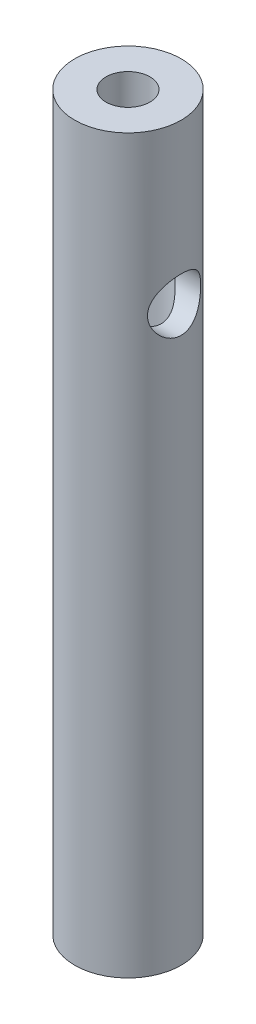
from build123d import *

# Parameters (mm, degrees)
SKETCH1_R                    = 4
BOSS_EXTRUDE1_DEPTH          = 55
M4_TAPPED_HOLE1_D            = 3.3
M4_TAPPED_HOLE1_DEPTH        = 10
M4_TAPPED_HOLE1_TIP          = 0.9914200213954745
F_4_0_4_DIAMETER_HOLE1_D     = 4
F_4_0_4_DIAMETER_HOLE1_DEPTH = 4
F_4_0_4_DIAMETER_HOLE1_TIP   = 1.2017212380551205
M6_TAPPED_HOLE1_D            = 5
M6_TAPPED_HOLE1_DEPTH        = 10
M6_TAPPED_HOLE1_TIP          = 1.5021515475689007
F_5_0_5_DIAMETER_HOLE1_D     = 5
F_5_0_5_DIAMETER_HOLE1_DEPTH = 45
F_5_0_5_DIAMETER_HOLE1_TIP   = 1.5021515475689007


with BuildPart() as part:
    # Sketch1 → Boss-Extrude1 (new body)
    with BuildSketch(Plane(origin=(0, 0, 0), x_dir=(1, 0, 0), z_dir=(0, 1, 0))):
        with Locations(Location((0, 0, 0), (0, 0, 270))):
            Circle(SKETCH1_R)
    extrude(amount=BOSS_EXTRUDE1_DEPTH)

    # M4 Tapped Hole1
    with Locations(Plane(origin=(0, 55, 0), x_dir=(1, 0, 0), z_dir=(0, 1, 0))):
        with Locations((0, 0)):
            Hole(M4_TAPPED_HOLE1_D / 2, depth=M4_TAPPED_HOLE1_DEPTH)
            with Locations((0, 0, -(M4_TAPPED_HOLE1_DEPTH + M4_TAPPED_HOLE1_TIP / 2))):  # 118° drill point
                Cone(0, M4_TAPPED_HOLE1_D / 2, M4_TAPPED_HOLE1_TIP, mode=Mode.SUBTRACT)

    # 4.0 _4_ Diameter Hole1
    with Locations(Plane(origin=(4, 43, 0), x_dir=(0, 0, 1), z_dir=(1, 0, 0))):
        with Locations((0, 0)):
            Hole(F_4_0_4_DIAMETER_HOLE1_D / 2, depth=F_4_0_4_DIAMETER_HOLE1_DEPTH)
            with Locations((0, 0, -(F_4_0_4_DIAMETER_HOLE1_DEPTH + F_4_0_4_DIAMETER_HOLE1_TIP / 2))):  # 118° drill point
                Cone(0, F_4_0_4_DIAMETER_HOLE1_D / 2, F_4_0_4_DIAMETER_HOLE1_TIP, mode=Mode.SUBTRACT)

    # M6 Tapped Hole1
    with Locations(Plane(origin=(0, 0, 0), x_dir=(-1, 0, 0), z_dir=(0, -1, 0))):
        with Locations((0, 0)):
            Hole(M6_TAPPED_HOLE1_D / 2, depth=M6_TAPPED_HOLE1_DEPTH)
            with Locations((0, 0, -(M6_TAPPED_HOLE1_DEPTH + M6_TAPPED_HOLE1_TIP / 2))):  # 118° drill point
                Cone(0, M6_TAPPED_HOLE1_D / 2, M6_TAPPED_HOLE1_TIP, mode=Mode.SUBTRACT)

    # 5.0 _5_ Diameter Hole1
    with Locations(Plane(origin=(0, 0, 0), x_dir=(-1, 0, 0), z_dir=(0, -1, 0))):
        with Locations((0, 0)):
            Hole(F_5_0_5_DIAMETER_HOLE1_D / 2, depth=F_5_0_5_DIAMETER_HOLE1_DEPTH)
            with Locations((0, 0, -(F_5_0_5_DIAMETER_HOLE1_DEPTH + F_5_0_5_DIAMETER_HOLE1_TIP / 2))):  # 118° drill point
                Cone(0, F_5_0_5_DIAMETER_HOLE1_D / 2, F_5_0_5_DIAMETER_HOLE1_TIP, mode=Mode.SUBTRACT)


solid = part.part
